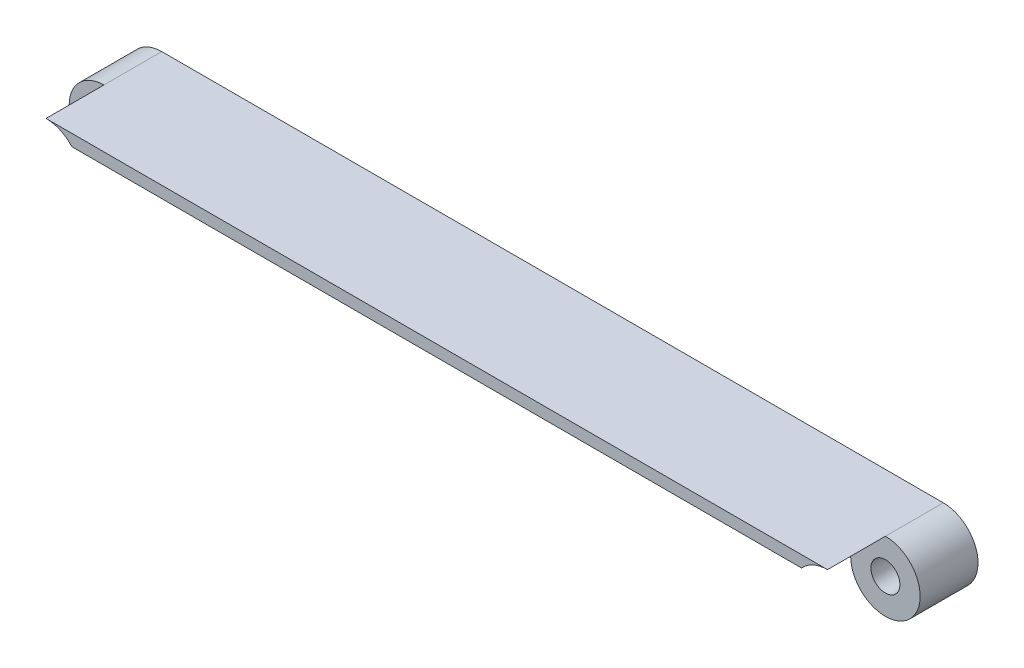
ISO-10303-21;
HEADER;
FILE_DESCRIPTION(('STEP AP214'),'2;1');
FILE_NAME('part.step','',(''),(''),'','','');
FILE_SCHEMA(('AUTOMOTIVE_DESIGN { 1 0 10303 214 1 1 1 1 }'));
ENDSEC;
DATA;
#1=APPLICATION_CONTEXT('core data for automotive mechanical design processes');
#2=APPLICATION_PROTOCOL_DEFINITION('international standard','automotive_design',2000,#1);
#3=PRODUCT_CONTEXT('',#1,'mechanical');
#4=PRODUCT('Part','Part','',(#3));
#5=PRODUCT_RELATED_PRODUCT_CATEGORY('part','',(#4));
#6=PRODUCT_DEFINITION_FORMATION('','',#4);
#7=PRODUCT_DEFINITION_CONTEXT('part definition',#1,'design');
#8=PRODUCT_DEFINITION('design','',#6,#7);
#9=PRODUCT_DEFINITION_SHAPE('','',#8);
#10=(LENGTH_UNIT() NAMED_UNIT(*) SI_UNIT(.MILLI.,.METRE.));
#11=(NAMED_UNIT(*) PLANE_ANGLE_UNIT() SI_UNIT($,.RADIAN.));
#12=(NAMED_UNIT(*) SI_UNIT($,.STERADIAN.) SOLID_ANGLE_UNIT());
#13=UNCERTAINTY_MEASURE_WITH_UNIT(LENGTH_MEASURE(1.E-05),#10,'distance_accuracy_value','');
#14=(GEOMETRIC_REPRESENTATION_CONTEXT(3) GLOBAL_UNCERTAINTY_ASSIGNED_CONTEXT((#13)) GLOBAL_UNIT_ASSIGNED_CONTEXT((#10,
#11,#12)) REPRESENTATION_CONTEXT('',''));
#15=CARTESIAN_POINT('',(0.,0.,0.));
#16=DIRECTION('',(0.,0.,1.));
#17=DIRECTION('',(1.,0.,0.));
#18=AXIS2_PLACEMENT_3D('',#15,#16,#17);
#19=CARTESIAN_POINT('',(-135.,0.,20.));
#20=DIRECTION('',(0.,0.,-1.));
#21=DIRECTION('',(-1.,0.,0.));
#22=AXIS2_PLACEMENT_3D('',#19,#20,#21);
#23=CYLINDRICAL_SURFACE('',#22,6.);
#24=CARTESIAN_POINT('',(-135.,0.,10.));
#25=DIRECTION('',(0.,0.,1.));
#26=DIRECTION('',(1.,0.,0.));
#27=AXIS2_PLACEMENT_3D('',#24,#25,#26);
#28=CIRCLE('',#27,6.00000000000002);
#29=CARTESIAN_POINT('',(-135.,6.,10.));
#30=VERTEX_POINT('',#29);
#31=CARTESIAN_POINT('',(-130.527864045,4.,10.));
#32=VERTEX_POINT('',#31);
#33=EDGE_CURVE('E131',#30,#32,#28,.T.);
#34=ORIENTED_EDGE('',*,*,#33,.F.);
#35=DIRECTION('',(0.,0.,-1.));
#36=VECTOR('',#35,1.);
#37=CARTESIAN_POINT('',(-135.,6.,20.));
#38=LINE('',#37,#36);
#39=CARTESIAN_POINT('',(-135.,6.,0.));
#40=VERTEX_POINT('',#39);
#41=EDGE_CURVE('E111',#30,#40,#38,.T.);
#42=ORIENTED_EDGE('',*,*,#41,.T.);
#43=CARTESIAN_POINT('',(-135.,0.,0.));
#44=DIRECTION('',(0.,0.,1.));
#45=DIRECTION('',(1.,0.,0.));
#46=AXIS2_PLACEMENT_3D('',#43,#44,#45);
#47=CIRCLE('',#46,6.);
#48=CARTESIAN_POINT('',(-130.527864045,4.,0.));
#49=VERTEX_POINT('',#48);
#50=EDGE_CURVE('E103',#40,#49,#47,.T.);
#51=ORIENTED_EDGE('',*,*,#50,.T.);
#52=DIRECTION('',(0.,0.,-1.));
#53=VECTOR('',#52,1.);
#54=CARTESIAN_POINT('',(-130.527864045,4.,20.));
#55=LINE('',#54,#53);
#56=EDGE_CURVE('E41',#32,#49,#55,.T.);
#57=ORIENTED_EDGE('',*,*,#56,.F.);
#58=EDGE_LOOP('',(#34,#42,#51,#57));
#59=FACE_BOUND('',#58,.T.);
#60=ADVANCED_FACE('F33',(#59),#23,.T.);
#61=CARTESIAN_POINT('',(0.,0.,20.));
#62=DIRECTION('',(0.,0.,-1.));
#63=DIRECTION('',(-1.,0.,0.));
#64=AXIS2_PLACEMENT_3D('',#61,#62,#63);
#65=CYLINDRICAL_SURFACE('',#64,6.);
#66=CARTESIAN_POINT('',(0.,0.,10.));
#67=DIRECTION('',(0.,0.,1.));
#68=DIRECTION('',(1.,0.,0.));
#69=AXIS2_PLACEMENT_3D('',#66,#67,#68);
#70=CIRCLE('',#69,6.);
#71=CARTESIAN_POINT('',(-4.47213595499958,4.,10.));
#72=VERTEX_POINT('',#71);
#73=CARTESIAN_POINT('',(0.,6.,10.));
#74=VERTEX_POINT('',#73);
#75=EDGE_CURVE('E120',#72,#74,#70,.T.);
#76=ORIENTED_EDGE('',*,*,#75,.F.);
#77=DIRECTION('',(0.,0.,-1.));
#78=VECTOR('',#77,1.);
#79=CARTESIAN_POINT('',(-4.47213595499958,4.,20.));
#80=LINE('',#79,#78);
#81=CARTESIAN_POINT('',(-4.47213595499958,4.,0.));
#82=VERTEX_POINT('',#81);
#83=EDGE_CURVE('E94',#72,#82,#80,.T.);
#84=ORIENTED_EDGE('',*,*,#83,.T.);
#85=CARTESIAN_POINT('',(0.,0.,0.));
#86=DIRECTION('',(0.,0.,1.));
#87=DIRECTION('',(1.,0.,0.));
#88=AXIS2_PLACEMENT_3D('',#85,#86,#87);
#89=CIRCLE('',#88,6.);
#90=CARTESIAN_POINT('',(0.,6.,0.));
#91=VERTEX_POINT('',#90);
#92=EDGE_CURVE('E91',#82,#91,#89,.T.);
#93=ORIENTED_EDGE('',*,*,#92,.T.);
#94=DIRECTION('',(0.,0.,-1.));
#95=VECTOR('',#94,1.);
#96=CARTESIAN_POINT('',(0.,6.,20.));
#97=LINE('',#96,#95);
#98=EDGE_CURVE('E77',#74,#91,#97,.T.);
#99=ORIENTED_EDGE('',*,*,#98,.F.);
#100=EDGE_LOOP('',(#76,#84,#93,#99));
#101=FACE_BOUND('',#100,.T.);
#102=ADVANCED_FACE('F92',(#101),#65,.T.);
#103=CARTESIAN_POINT('',(-135.,0.,20.));
#104=DIRECTION('',(0.,0.,-1.));
#105=DIRECTION('',(-1.,0.,0.));
#106=AXIS2_PLACEMENT_3D('',#103,#104,#105);
#107=CYLINDRICAL_SURFACE('',#106,2.5);
#108=CARTESIAN_POINT('',(-135.,0.,0.));
#109=DIRECTION('',(0.,0.,1.));
#110=DIRECTION('',(1.,0.,0.));
#111=AXIS2_PLACEMENT_3D('',#108,#109,#110);
#112=CIRCLE('',#111,2.5);
#113=CARTESIAN_POINT('',(-132.5,0.,0.));
#114=VERTEX_POINT('',#113);
#115=EDGE_CURVE('E135',#114,#114,#112,.T.);
#116=ORIENTED_EDGE('',*,*,#115,.F.);
#117=EDGE_LOOP('',(#116));
#118=FACE_BOUND('',#117,.T.);
#119=CARTESIAN_POINT('',(-135.,0.,10.));
#120=DIRECTION('',(0.,0.,1.));
#121=DIRECTION('',(1.,0.,0.));
#122=AXIS2_PLACEMENT_3D('',#119,#120,#121);
#123=CIRCLE('',#122,2.5);
#124=CARTESIAN_POINT('',(-132.5,0.,10.));
#125=VERTEX_POINT('',#124);
#126=EDGE_CURVE('E36',#125,#125,#123,.T.);
#127=ORIENTED_EDGE('',*,*,#126,.T.);
#128=EDGE_LOOP('',(#127));
#129=FACE_BOUND('',#128,.T.);
#130=ADVANCED_FACE('F178',(#118,#129),#107,.F.);
#131=CARTESIAN_POINT('',(0.,0.,20.));
#132=DIRECTION('',(0.,0.,-1.));
#133=DIRECTION('',(-1.,0.,0.));
#134=AXIS2_PLACEMENT_3D('',#131,#132,#133);
#135=CYLINDRICAL_SURFACE('',#134,2.5);
#136=CARTESIAN_POINT('',(0.,0.,0.));
#137=DIRECTION('',(0.,0.,1.));
#138=DIRECTION('',(1.,0.,0.));
#139=AXIS2_PLACEMENT_3D('',#136,#137,#138);
#140=CIRCLE('',#139,2.5);
#141=CARTESIAN_POINT('',(2.5,0.,0.));
#142=VERTEX_POINT('',#141);
#143=EDGE_CURVE('E119',#142,#142,#140,.T.);
#144=ORIENTED_EDGE('',*,*,#143,.F.);
#145=EDGE_LOOP('',(#144));
#146=FACE_BOUND('',#145,.T.);
#147=CARTESIAN_POINT('',(0.,0.,10.));
#148=DIRECTION('',(0.,0.,1.));
#149=DIRECTION('',(1.,0.,0.));
#150=AXIS2_PLACEMENT_3D('',#147,#148,#149);
#151=CIRCLE('',#150,2.5);
#152=CARTESIAN_POINT('',(2.5,0.,10.));
#153=VERTEX_POINT('',#152);
#154=EDGE_CURVE('E114',#153,#153,#151,.T.);
#155=ORIENTED_EDGE('',*,*,#154,.T.);
#156=EDGE_LOOP('',(#155));
#157=FACE_BOUND('',#156,.T.);
#158=ADVANCED_FACE('F183',(#146,#157),#135,.F.);
#159=CARTESIAN_POINT('',(-135.,0.,20.));
#160=DIRECTION('',(0.,0.,1.));
#161=DIRECTION('',(1.,0.,0.));
#162=AXIS2_PLACEMENT_3D('',#159,#160,#161);
#163=PLANE('',#162);
#164=CARTESIAN_POINT('',(0.,0.,20.));
#165=DIRECTION('',(0.,0.,1.));
#166=DIRECTION('',(1.,0.,0.));
#167=AXIS2_PLACEMENT_3D('',#164,#165,#166);
#168=CIRCLE('',#167,6.);
#169=CARTESIAN_POINT('',(0.,6.,20.));
#170=VERTEX_POINT('',#169);
#171=CARTESIAN_POINT('',(-4.47213595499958,4.,20.));
#172=VERTEX_POINT('',#171);
#173=EDGE_CURVE('E124',#170,#172,#168,.T.);
#174=ORIENTED_EDGE('',*,*,#173,.F.);
#175=DIRECTION('',(-1.,0.,0.));
#176=VECTOR('',#175,1.);
#177=CARTESIAN_POINT('',(-135.,6.,20.));
#178=LINE('',#177,#176);
#179=CARTESIAN_POINT('',(-135.,6.,20.));
#180=VERTEX_POINT('',#179);
#181=EDGE_CURVE('E107',#170,#180,#178,.T.);
#182=ORIENTED_EDGE('',*,*,#181,.T.);
#183=CARTESIAN_POINT('',(-135.,0.,20.));
#184=DIRECTION('',(0.,0.,1.));
#185=DIRECTION('',(1.,0.,0.));
#186=AXIS2_PLACEMENT_3D('',#183,#184,#185);
#187=CIRCLE('',#186,6.00000000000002);
#188=CARTESIAN_POINT('',(-130.527864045,4.,20.));
#189=VERTEX_POINT('',#188);
#190=EDGE_CURVE('E58',#189,#180,#187,.T.);
#191=ORIENTED_EDGE('',*,*,#190,.F.);
#192=DIRECTION('',(1.,0.,0.));
#193=VECTOR('',#192,1.);
#194=CARTESIAN_POINT('',(-130.527864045,4.,20.));
#195=LINE('',#194,#193);
#196=EDGE_CURVE('E104',#189,#172,#195,.T.);
#197=ORIENTED_EDGE('',*,*,#196,.T.);
#198=EDGE_LOOP('',(#174,#182,#191,#197));
#199=FACE_BOUND('',#198,.T.);
#200=ADVANCED_FACE('F160',(#199),#163,.T.);
#201=CARTESIAN_POINT('',(-135.,0.,0.));
#202=DIRECTION('',(0.,0.,1.));
#203=DIRECTION('',(1.,0.,0.));
#204=AXIS2_PLACEMENT_3D('',#201,#202,#203);
#205=PLANE('',#204);
#206=ORIENTED_EDGE('',*,*,#50,.F.);
#207=DIRECTION('',(-1.,0.,0.));
#208=VECTOR('',#207,1.);
#209=CARTESIAN_POINT('',(-135.,6.,0.));
#210=LINE('',#209,#208);
#211=EDGE_CURVE('E82',#91,#40,#210,.T.);
#212=ORIENTED_EDGE('',*,*,#211,.F.);
#213=ORIENTED_EDGE('',*,*,#92,.F.);
#214=DIRECTION('',(1.,0.,0.));
#215=VECTOR('',#214,1.);
#216=CARTESIAN_POINT('',(-130.527864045,4.,0.));
#217=LINE('',#216,#215);
#218=EDGE_CURVE('E98',#49,#82,#217,.T.);
#219=ORIENTED_EDGE('',*,*,#218,.F.);
#220=EDGE_LOOP('',(#206,#212,#213,#219));
#221=FACE_BOUND('',#220,.T.);
#222=ORIENTED_EDGE('',*,*,#115,.T.);
#223=EDGE_LOOP('',(#222));
#224=FACE_BOUND('',#223,.T.);
#225=ORIENTED_EDGE('',*,*,#143,.T.);
#226=EDGE_LOOP('',(#225));
#227=FACE_BOUND('',#226,.T.);
#228=ADVANCED_FACE('F100',(#221,#224,#227),#205,.F.);
#229=CARTESIAN_POINT('',(-130.527864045,4.,20.));
#230=DIRECTION('',(0.,1.,0.));
#231=DIRECTION('',(0.,0.,1.));
#232=AXIS2_PLACEMENT_3D('',#229,#230,#231);
#233=PLANE('',#232);
#234=ORIENTED_EDGE('',*,*,#218,.T.);
#235=ORIENTED_EDGE('',*,*,#83,.F.);
#236=EDGE_CURVE('E113',#172,#72,#80,.T.);
#237=ORIENTED_EDGE('',*,*,#236,.F.);
#238=ORIENTED_EDGE('',*,*,#196,.F.);
#239=EDGE_CURVE('E11',#189,#32,#55,.T.);
#240=ORIENTED_EDGE('',*,*,#239,.T.);
#241=ORIENTED_EDGE('',*,*,#56,.T.);
#242=EDGE_LOOP('',(#234,#235,#237,#238,#240,#241));
#243=FACE_BOUND('',#242,.T.);
#244=ADVANCED_FACE('F140',(#243),#233,.F.);
#245=CARTESIAN_POINT('',(-135.,6.,20.));
#246=DIRECTION('',(0.,-1.,0.));
#247=DIRECTION('',(0.,0.,-1.));
#248=AXIS2_PLACEMENT_3D('',#245,#246,#247);
#249=PLANE('',#248);
#250=ORIENTED_EDGE('',*,*,#211,.T.);
#251=ORIENTED_EDGE('',*,*,#41,.F.);
#252=EDGE_CURVE('E88',#180,#30,#38,.T.);
#253=ORIENTED_EDGE('',*,*,#252,.F.);
#254=ORIENTED_EDGE('',*,*,#181,.F.);
#255=EDGE_CURVE('E85',#170,#74,#97,.T.);
#256=ORIENTED_EDGE('',*,*,#255,.T.);
#257=ORIENTED_EDGE('',*,*,#98,.T.);
#258=EDGE_LOOP('',(#250,#251,#253,#254,#256,#257));
#259=FACE_BOUND('',#258,.T.);
#260=ADVANCED_FACE('F79',(#259),#249,.F.);
#261=CARTESIAN_POINT('',(0.,0.,10.));
#262=DIRECTION('',(0.,0.,1.));
#263=DIRECTION('',(1.,0.,0.));
#264=AXIS2_PLACEMENT_3D('',#261,#262,#263);
#265=CYLINDRICAL_SURFACE('',#264,6.);
#266=EDGE_CURVE('E49',#74,#72,#70,.T.);
#267=ORIENTED_EDGE('',*,*,#266,.F.);
#268=ORIENTED_EDGE('',*,*,#255,.F.);
#269=ORIENTED_EDGE('',*,*,#173,.T.);
#270=ORIENTED_EDGE('',*,*,#236,.T.);
#271=EDGE_LOOP('',(#267,#268,#269,#270));
#272=FACE_BOUND('',#271,.T.);
#273=ADVANCED_FACE('F158',(#272),#265,.F.);
#274=CARTESIAN_POINT('',(0.,0.,10.));
#275=DIRECTION('',(0.,0.,1.));
#276=DIRECTION('',(1.,0.,0.));
#277=AXIS2_PLACEMENT_3D('',#274,#275,#276);
#278=PLANE('',#277);
#279=ORIENTED_EDGE('',*,*,#154,.F.);
#280=EDGE_LOOP('',(#279));
#281=FACE_BOUND('',#280,.T.);
#282=ORIENTED_EDGE('',*,*,#266,.T.);
#283=ORIENTED_EDGE('',*,*,#75,.T.);
#284=EDGE_LOOP('',(#282,#283));
#285=FACE_BOUND('',#284,.T.);
#286=ADVANCED_FACE('F170',(#281,#285),#278,.T.);
#287=CARTESIAN_POINT('',(-135.,0.,10.));
#288=DIRECTION('',(0.,0.,1.));
#289=DIRECTION('',(1.,0.,0.));
#290=AXIS2_PLACEMENT_3D('',#287,#288,#289);
#291=CYLINDRICAL_SURFACE('',#290,6.00000000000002);
#292=ORIENTED_EDGE('',*,*,#190,.T.);
#293=ORIENTED_EDGE('',*,*,#252,.T.);
#294=EDGE_CURVE('E128',#32,#30,#28,.T.);
#295=ORIENTED_EDGE('',*,*,#294,.F.);
#296=ORIENTED_EDGE('',*,*,#239,.F.);
#297=EDGE_LOOP('',(#292,#293,#295,#296));
#298=FACE_BOUND('',#297,.T.);
#299=ADVANCED_FACE('F162',(#298),#291,.F.);
#300=CARTESIAN_POINT('',(-135.,0.,10.));
#301=DIRECTION('',(0.,0.,1.));
#302=DIRECTION('',(1.,0.,0.));
#303=AXIS2_PLACEMENT_3D('',#300,#301,#302);
#304=PLANE('',#303);
#305=ORIENTED_EDGE('',*,*,#126,.F.);
#306=EDGE_LOOP('',(#305));
#307=FACE_BOUND('',#306,.T.);
#308=ORIENTED_EDGE('',*,*,#294,.T.);
#309=ORIENTED_EDGE('',*,*,#33,.T.);
#310=EDGE_LOOP('',(#308,#309));
#311=FACE_BOUND('',#310,.T.);
#312=ADVANCED_FACE('F163',(#307,#311),#304,.T.);
#313=CLOSED_SHELL('',(#60,#102,#130,#158,#200,#228,#244,#260,#273,#286,#299,#312));
#314=MANIFOLD_SOLID_BREP('B2',#313);
#315=ADVANCED_BREP_SHAPE_REPRESENTATION('',(#18,#314),#14);
#316=SHAPE_DEFINITION_REPRESENTATION(#9,#315);
ENDSEC;
END-ISO-10303-21;
